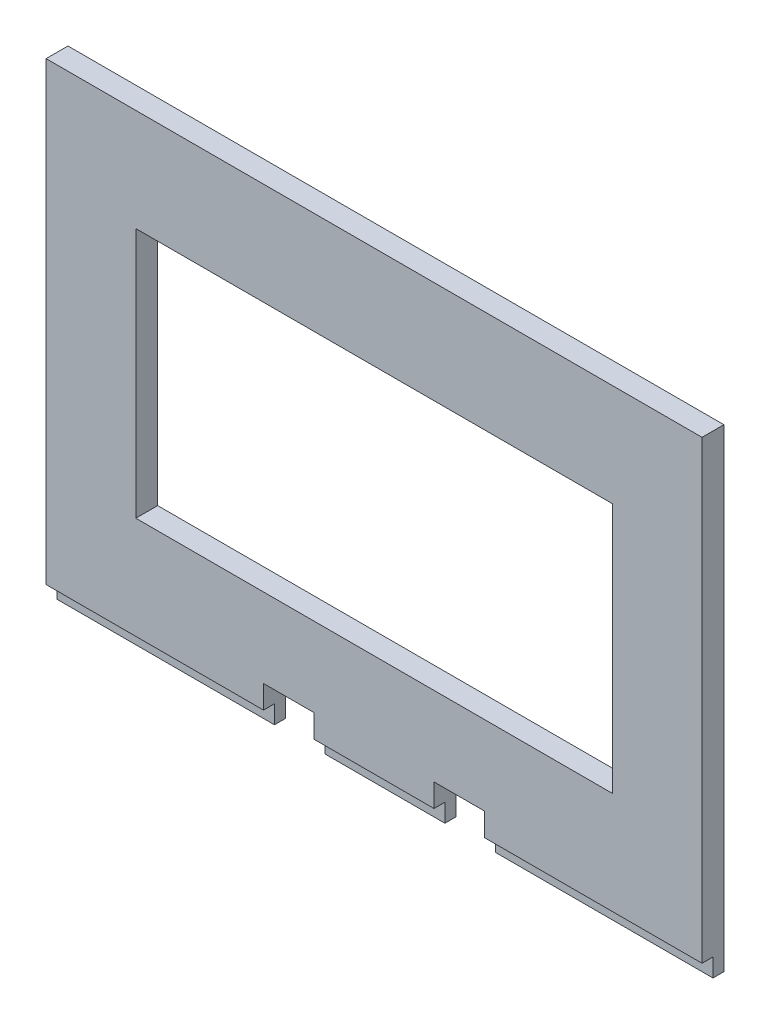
from build123d import *

# Parameters (mm, degrees)
SKETCH_1_W          = 180
SKETCH_1_H          = 125
EXTRUDE_1_DEPTH     = 4
SKETCH_2_W          = 180
SKETCH_2_H          = 125
EXTRUDE_2_DEPTH     = 2
SKETCH_3_W          = 180
SKETCH_3_H          = 3
EXTRUDE_3_DEPTH     = 5
SKETCH_4_W          = 130.769376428
SKETCH_4_H          = 68.841810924
CUT_EXTRUDE_1_DEPTH = 113.659886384
SKETCH_6_W          = 13.885693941
SKETCH_6_H          = 11.329000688
CUT_EXTRUDE_2_DEPTH = 10
SKETCH_9_W          = 13.885693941
SKETCH_9_H          = 11.329000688
CUT_EXTRUDE_3_DEPTH = 10


with BuildPart() as part:
    # Sketch 1 → Extrude 1 (new body)
    with BuildSketch(Plane.XY):
        Rectangle(SKETCH_1_W, SKETCH_1_H)
    extrude(amount=EXTRUDE_1_DEPTH)

    # Sketch 2 → Extrude 2 (add)
    with BuildSketch(Plane.XY.offset(4)):
        Rectangle(SKETCH_2_W, SKETCH_2_H)
    extrude(amount=EXTRUDE_2_DEPTH)

    # Sketch 3 → Extrude 3 (add)
    with BuildSketch(Plane.XZ.offset(62.5)):
        with Locations((0, 1.5)):
            Rectangle(SKETCH_3_W, SKETCH_3_H)
    extrude(amount=EXTRUDE_3_DEPTH)

    # Sketch 4 → Cut-Extrude 1 (cut, through all)
    with BuildSketch(Plane.XY.offset(6)):
        Rectangle(SKETCH_4_W, SKETCH_4_H)
    extrude(amount=-CUT_EXTRUDE_1_DEPTH, mode=Mode.SUBTRACT)

    # Sketch 6 → Cut-Extrude 2 (cut)
    with BuildSketch(Plane(origin=(0, 0, 0), x_dir=(-1, 0, 0), z_dir=(0, 0, -1))):
        with Locations((-23.389764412, -61.835499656)):
            Rectangle(SKETCH_6_W, SKETCH_6_H)
    extrude(amount=-CUT_EXTRUDE_2_DEPTH, mode=Mode.SUBTRACT)

    # Sketch 9 → Cut-Extrude 3 (cut)
    with BuildSketch(Plane(origin=(0, 0, 0), x_dir=(-1, 0, 0), z_dir=(0, 0, -1))):
        with Locations((23.389764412, -61.835499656)):
            Rectangle(SKETCH_9_W, SKETCH_9_H)
    extrude(amount=-CUT_EXTRUDE_3_DEPTH, mode=Mode.SUBTRACT)


solid = part.part
